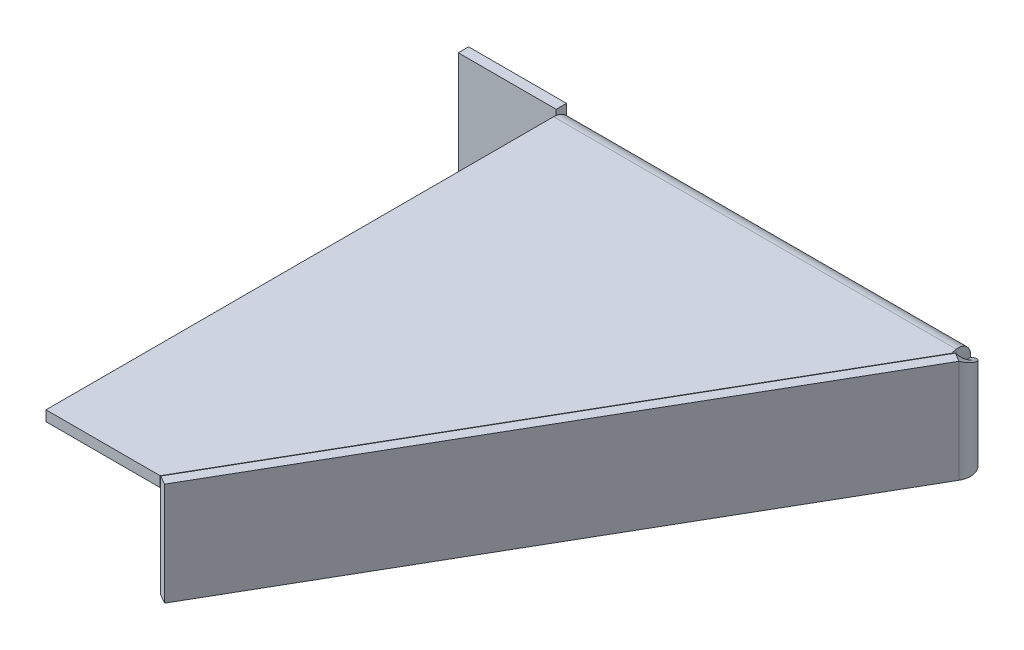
ISO-10303-21;
HEADER;
FILE_DESCRIPTION(('STEP AP214'),'2;1');
FILE_NAME('part.step','',(''),(''),'','','');
FILE_SCHEMA(('AUTOMOTIVE_DESIGN { 1 0 10303 214 1 1 1 1 }'));
ENDSEC;
DATA;
#1=APPLICATION_CONTEXT('core data for automotive mechanical design processes');
#2=APPLICATION_PROTOCOL_DEFINITION('international standard','automotive_design',2000,#1);
#3=PRODUCT_CONTEXT('',#1,'mechanical');
#4=PRODUCT('Part','Part','',(#3));
#5=PRODUCT_RELATED_PRODUCT_CATEGORY('part','',(#4));
#6=PRODUCT_DEFINITION_FORMATION('','',#4);
#7=PRODUCT_DEFINITION_CONTEXT('part definition',#1,'design');
#8=PRODUCT_DEFINITION('design','',#6,#7);
#9=PRODUCT_DEFINITION_SHAPE('','',#8);
#10=(LENGTH_UNIT() NAMED_UNIT(*) SI_UNIT(.MILLI.,.METRE.));
#11=(NAMED_UNIT(*) PLANE_ANGLE_UNIT() SI_UNIT($,.RADIAN.));
#12=(NAMED_UNIT(*) SI_UNIT($,.STERADIAN.) SOLID_ANGLE_UNIT());
#13=UNCERTAINTY_MEASURE_WITH_UNIT(LENGTH_MEASURE(1.E-05),#10,'distance_accuracy_value','');
#14=(GEOMETRIC_REPRESENTATION_CONTEXT(3) GLOBAL_UNCERTAINTY_ASSIGNED_CONTEXT((#13)) GLOBAL_UNIT_ASSIGNED_CONTEXT((#10,
#11,#12)) REPRESENTATION_CONTEXT('',''));
#15=CARTESIAN_POINT('',(0.,0.,0.));
#16=DIRECTION('',(0.,0.,1.));
#17=DIRECTION('',(1.,0.,0.));
#18=AXIS2_PLACEMENT_3D('',#15,#16,#17);
#19=CARTESIAN_POINT('',(0.,20.,2.));
#20=DIRECTION('',(0.,0.,-1.));
#21=DIRECTION('',(-1.,0.,0.));
#22=AXIS2_PLACEMENT_3D('',#19,#20,#21);
#23=PLANE('',#22);
#24=DIRECTION('',(0.,-1.,0.));
#25=VECTOR('',#24,1.);
#26=CARTESIAN_POINT('',(97.4019237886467,16.5,2.));
#27=LINE('',#26,#25);
#28=CARTESIAN_POINT('',(97.4019237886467,16.5,2.));
#29=VERTEX_POINT('',#28);
#30=CARTESIAN_POINT('',(97.4019237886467,0.,2.));
#31=VERTEX_POINT('',#30);
#32=EDGE_CURVE('E409',#29,#31,#27,.T.);
#33=ORIENTED_EDGE('',*,*,#32,.F.);
#34=DIRECTION('',(1.,0.,0.));
#35=VECTOR('',#34,1.);
#36=CARTESIAN_POINT('',(19.9999999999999,16.5,2.));
#37=LINE('',#36,#35);
#38=CARTESIAN_POINT('',(20.,16.5,2.));
#39=VERTEX_POINT('',#38);
#40=EDGE_CURVE('E512',#39,#29,#37,.T.);
#41=ORIENTED_EDGE('',*,*,#40,.F.);
#42=DIRECTION('',(0.,1.,0.));
#43=VECTOR('',#42,1.);
#44=CARTESIAN_POINT('',(19.9999999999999,15.5,2.));
#45=LINE('',#44,#43);
#46=CARTESIAN_POINT('',(19.9999999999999,15.5,2.));
#47=VERTEX_POINT('',#46);
#48=EDGE_CURVE('E500',#47,#39,#45,.T.);
#49=ORIENTED_EDGE('',*,*,#48,.F.);
#50=DIRECTION('',(1.,0.,0.));
#51=VECTOR('',#50,1.);
#52=CARTESIAN_POINT('',(18.9999999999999,15.5,1.99999999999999));
#53=LINE('',#52,#51);
#54=CARTESIAN_POINT('',(18.9999999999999,15.5,1.99999999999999));
#55=VERTEX_POINT('',#54);
#56=EDGE_CURVE('E499',#55,#47,#53,.T.);
#57=ORIENTED_EDGE('',*,*,#56,.F.);
#58=DIRECTION('',(0.,-1.,0.));
#59=VECTOR('',#58,1.);
#60=CARTESIAN_POINT('',(18.9999999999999,20.,1.99999999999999));
#61=LINE('',#60,#59);
#62=CARTESIAN_POINT('',(18.9999999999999,20.,1.99999999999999));
#63=VERTEX_POINT('',#62);
#64=EDGE_CURVE('E497',#63,#55,#61,.T.);
#65=ORIENTED_EDGE('',*,*,#64,.F.);
#66=DIRECTION('',(-1.,0.,0.));
#67=VECTOR('',#66,1.);
#68=CARTESIAN_POINT('',(0.,20.,2.));
#69=LINE('',#68,#67);
#70=CARTESIAN_POINT('',(0.,20.,2.));
#71=VERTEX_POINT('',#70);
#72=EDGE_CURVE('E417',#63,#71,#69,.T.);
#73=ORIENTED_EDGE('',*,*,#72,.T.);
#74=DIRECTION('',(0.,-1.,0.));
#75=VECTOR('',#74,1.);
#76=CARTESIAN_POINT('',(0.,0.,2.));
#77=LINE('',#76,#75);
#78=CARTESIAN_POINT('',(0.,0.,2.));
#79=VERTEX_POINT('',#78);
#80=EDGE_CURVE('E415',#71,#79,#77,.T.);
#81=ORIENTED_EDGE('',*,*,#80,.T.);
#82=DIRECTION('',(1.,0.,0.));
#83=VECTOR('',#82,1.);
#84=CARTESIAN_POINT('',(0.,0.,2.));
#85=LINE('',#84,#83);
#86=EDGE_CURVE('E403',#79,#31,#85,.T.);
#87=ORIENTED_EDGE('',*,*,#86,.T.);
#88=EDGE_LOOP('',(#33,#41,#49,#57,#65,#73,#81,#87));
#89=FACE_BOUND('',#88,.T.);
#90=ADVANCED_FACE('F72',(#89),#23,.F.);
#91=CARTESIAN_POINT('',(0.,20.,0.));
#92=DIRECTION('',(0.,0.,-1.));
#93=DIRECTION('',(-1.,0.,0.));
#94=AXIS2_PLACEMENT_3D('',#91,#92,#93);
#95=PLANE('',#94);
#96=DIRECTION('',(1.,0.,0.));
#97=VECTOR('',#96,1.);
#98=CARTESIAN_POINT('',(20.,16.5,0.));
#99=LINE('',#98,#97);
#100=CARTESIAN_POINT('',(20.,16.5,0.));
#101=VERTEX_POINT('',#100);
#102=CARTESIAN_POINT('',(97.4019237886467,16.5,0.));
#103=VERTEX_POINT('',#102);
#104=EDGE_CURVE('E81',#101,#103,#99,.T.);
#105=ORIENTED_EDGE('',*,*,#104,.T.);
#106=DIRECTION('',(0.,-1.,0.));
#107=VECTOR('',#106,1.);
#108=CARTESIAN_POINT('',(97.4019237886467,16.5,0.));
#109=LINE('',#108,#107);
#110=CARTESIAN_POINT('',(97.4019237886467,0.,0.));
#111=VERTEX_POINT('',#110);
#112=EDGE_CURVE('E408',#103,#111,#109,.T.);
#113=ORIENTED_EDGE('',*,*,#112,.T.);
#114=DIRECTION('',(1.,0.,0.));
#115=VECTOR('',#114,1.);
#116=CARTESIAN_POINT('',(0.,0.,0.));
#117=LINE('',#116,#115);
#118=CARTESIAN_POINT('',(0.,0.,0.));
#119=VERTEX_POINT('',#118);
#120=EDGE_CURVE('E97',#119,#111,#117,.T.);
#121=ORIENTED_EDGE('',*,*,#120,.F.);
#122=DIRECTION('',(0.,-1.,0.));
#123=VECTOR('',#122,1.);
#124=CARTESIAN_POINT('',(0.,0.,0.));
#125=LINE('',#124,#123);
#126=CARTESIAN_POINT('',(0.,20.,0.));
#127=VERTEX_POINT('',#126);
#128=EDGE_CURVE('E555',#127,#119,#125,.T.);
#129=ORIENTED_EDGE('',*,*,#128,.F.);
#130=DIRECTION('',(-1.,0.,0.));
#131=VECTOR('',#130,1.);
#132=CARTESIAN_POINT('',(0.,20.,0.));
#133=LINE('',#132,#131);
#134=CARTESIAN_POINT('',(18.9999999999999,20.,0.));
#135=VERTEX_POINT('',#134);
#136=EDGE_CURVE('E505',#135,#127,#133,.T.);
#137=ORIENTED_EDGE('',*,*,#136,.F.);
#138=DIRECTION('',(0.,-1.,0.));
#139=VECTOR('',#138,1.);
#140=CARTESIAN_POINT('',(18.9999999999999,20.,0.));
#141=LINE('',#140,#139);
#142=CARTESIAN_POINT('',(18.9999999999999,15.5,0.));
#143=VERTEX_POINT('',#142);
#144=EDGE_CURVE('E420',#135,#143,#141,.T.);
#145=ORIENTED_EDGE('',*,*,#144,.T.);
#146=DIRECTION('',(1.,0.,0.));
#147=VECTOR('',#146,1.);
#148=CARTESIAN_POINT('',(0.,15.5,0.));
#149=LINE('',#148,#147);
#150=CARTESIAN_POINT('',(20.,15.5,0.));
#151=VERTEX_POINT('',#150);
#152=EDGE_CURVE('E485',#143,#151,#149,.T.);
#153=ORIENTED_EDGE('',*,*,#152,.T.);
#154=DIRECTION('',(0.,1.,0.));
#155=VECTOR('',#154,1.);
#156=CARTESIAN_POINT('',(20.,20.,0.));
#157=LINE('',#156,#155);
#158=EDGE_CURVE('E493',#151,#101,#157,.T.);
#159=ORIENTED_EDGE('',*,*,#158,.T.);
#160=EDGE_LOOP('',(#105,#113,#121,#129,#137,#145,#153,#159));
#161=FACE_BOUND('',#160,.T.);
#162=ADVANCED_FACE('F381',(#161),#95,.T.);
#163=CARTESIAN_POINT('',(0.,0.,2.));
#164=DIRECTION('',(0.,1.,0.));
#165=DIRECTION('',(0.,0.,1.));
#166=AXIS2_PLACEMENT_3D('',#163,#164,#165);
#167=PLANE('',#166);
#168=DIRECTION('',(0.,0.,-1.));
#169=VECTOR('',#168,1.);
#170=CARTESIAN_POINT('',(97.4019237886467,0.,2.));
#171=LINE('',#170,#169);
#172=EDGE_CURVE('E401',#31,#111,#171,.T.);
#173=ORIENTED_EDGE('',*,*,#172,.F.);
#174=ORIENTED_EDGE('',*,*,#86,.F.);
#175=DIRECTION('',(0.,0.,-1.));
#176=VECTOR('',#175,1.);
#177=CARTESIAN_POINT('',(0.,0.,2.));
#178=LINE('',#177,#176);
#179=EDGE_CURVE('E562',#79,#119,#178,.T.);
#180=ORIENTED_EDGE('',*,*,#179,.T.);
#181=ORIENTED_EDGE('',*,*,#120,.T.);
#182=EDGE_LOOP('',(#173,#174,#180,#181));
#183=FACE_BOUND('',#182,.T.);
#184=ADVANCED_FACE('F387',(#183),#167,.F.);
#185=CARTESIAN_POINT('',(0.,20.,2.));
#186=DIRECTION('',(0.,-1.,0.));
#187=DIRECTION('',(0.,0.,-1.));
#188=AXIS2_PLACEMENT_3D('',#185,#186,#187);
#189=PLANE('',#188);
#190=DIRECTION('',(0.,0.,-1.));
#191=VECTOR('',#190,1.);
#192=CARTESIAN_POINT('',(18.9999999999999,20.,1.99999999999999));
#193=LINE('',#192,#191);
#194=EDGE_CURVE('E550',#63,#135,#193,.T.);
#195=ORIENTED_EDGE('',*,*,#194,.T.);
#196=ORIENTED_EDGE('',*,*,#136,.T.);
#197=DIRECTION('',(0.,0.,-1.));
#198=VECTOR('',#197,1.);
#199=CARTESIAN_POINT('',(0.,20.,2.));
#200=LINE('',#199,#198);
#201=EDGE_CURVE('E554',#71,#127,#200,.T.);
#202=ORIENTED_EDGE('',*,*,#201,.F.);
#203=ORIENTED_EDGE('',*,*,#72,.F.);
#204=EDGE_LOOP('',(#195,#196,#202,#203));
#205=FACE_BOUND('',#204,.T.);
#206=ADVANCED_FACE('F394',(#205),#189,.F.);
#207=CARTESIAN_POINT('',(0.,0.,2.));
#208=DIRECTION('',(1.,0.,0.));
#209=DIRECTION('',(0.,0.,-1.));
#210=AXIS2_PLACEMENT_3D('',#207,#208,#209);
#211=PLANE('',#210);
#212=ORIENTED_EDGE('',*,*,#128,.T.);
#213=ORIENTED_EDGE('',*,*,#179,.F.);
#214=ORIENTED_EDGE('',*,*,#80,.F.);
#215=ORIENTED_EDGE('',*,*,#201,.T.);
#216=EDGE_LOOP('',(#212,#213,#214,#215));
#217=FACE_BOUND('',#216,.T.);
#218=ADVANCED_FACE('F74',(#217),#211,.F.);
#219=CARTESIAN_POINT('',(18.9999999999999,20.,1.99999999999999));
#220=DIRECTION('',(1.,0.,0.));
#221=DIRECTION('',(0.,0.,-1.));
#222=AXIS2_PLACEMENT_3D('',#219,#220,#221);
#223=PLANE('',#222);
#224=ORIENTED_EDGE('',*,*,#144,.F.);
#225=ORIENTED_EDGE('',*,*,#194,.F.);
#226=ORIENTED_EDGE('',*,*,#64,.T.);
#227=DIRECTION('',(0.,0.,-1.));
#228=VECTOR('',#227,1.);
#229=CARTESIAN_POINT('',(18.9999999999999,15.5,1.99999999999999));
#230=LINE('',#229,#228);
#231=EDGE_CURVE('E488',#55,#143,#230,.T.);
#232=ORIENTED_EDGE('',*,*,#231,.T.);
#233=EDGE_LOOP('',(#224,#225,#226,#232));
#234=FACE_BOUND('',#233,.T.);
#235=ADVANCED_FACE('F391',(#234),#223,.T.);
#236=CARTESIAN_POINT('',(18.9999999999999,15.5,1.99999999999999));
#237=DIRECTION('',(0.,1.,0.));
#238=DIRECTION('',(0.,0.,1.));
#239=AXIS2_PLACEMENT_3D('',#236,#237,#238);
#240=PLANE('',#239);
#241=ORIENTED_EDGE('',*,*,#152,.F.);
#242=ORIENTED_EDGE('',*,*,#231,.F.);
#243=ORIENTED_EDGE('',*,*,#56,.T.);
#244=DIRECTION('',(0.,0.,-1.));
#245=VECTOR('',#244,1.);
#246=CARTESIAN_POINT('',(19.9999999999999,15.5,2.));
#247=LINE('',#246,#245);
#248=EDGE_CURVE('E490',#47,#151,#247,.T.);
#249=ORIENTED_EDGE('',*,*,#248,.T.);
#250=EDGE_LOOP('',(#241,#242,#243,#249));
#251=FACE_BOUND('',#250,.T.);
#252=ADVANCED_FACE('F475',(#251),#240,.T.);
#253=CARTESIAN_POINT('',(19.9999999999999,15.5,2.));
#254=DIRECTION('',(-1.,0.,0.));
#255=DIRECTION('',(0.,0.,1.));
#256=AXIS2_PLACEMENT_3D('',#253,#254,#255);
#257=PLANE('',#256);
#258=ORIENTED_EDGE('',*,*,#158,.F.);
#259=ORIENTED_EDGE('',*,*,#248,.F.);
#260=ORIENTED_EDGE('',*,*,#48,.T.);
#261=DIRECTION('',(0.,0.,-1.));
#262=VECTOR('',#261,1.);
#263=CARTESIAN_POINT('',(19.9999999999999,16.5,2.));
#264=LINE('',#263,#262);
#265=EDGE_CURVE('E13',#39,#101,#264,.T.);
#266=ORIENTED_EDGE('',*,*,#265,.T.);
#267=EDGE_LOOP('',(#258,#259,#260,#266));
#268=FACE_BOUND('',#267,.T.);
#269=ADVANCED_FACE('F472',(#268),#257,.T.);
#270=CARTESIAN_POINT('',(43.9970238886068,0.,103.));
#271=DIRECTION('',(0.499999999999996,0.,-0.866025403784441));
#272=DIRECTION('',(-0.866025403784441,0.,-0.499999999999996));
#273=AXIS2_PLACEMENT_3D('',#270,#271,#272);
#274=PLANE('',#273);
#275=DIRECTION('',(0.,-1.,0.));
#276=VECTOR('',#275,1.);
#277=CARTESIAN_POINT('',(42.2649730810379,0.,102.));
#278=LINE('',#277,#276);
#279=CARTESIAN_POINT('',(42.2649730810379,20.0000000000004,102.));
#280=VERTEX_POINT('',#279);
#281=CARTESIAN_POINT('',(42.2649730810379,0.,102.));
#282=VERTEX_POINT('',#281);
#283=EDGE_CURVE('E435',#280,#282,#278,.T.);
#284=ORIENTED_EDGE('',*,*,#283,.T.);
#285=DIRECTION('',(-0.866025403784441,0.,-0.499999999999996));
#286=VECTOR('',#285,1.);
#287=CARTESIAN_POINT('',(43.9970238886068,0.,103.));
#288=LINE('',#287,#286);
#289=CARTESIAN_POINT('',(43.9970238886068,0.,103.));
#290=VERTEX_POINT('',#289);
#291=EDGE_CURVE('E428',#290,#282,#288,.T.);
#292=ORIENTED_EDGE('',*,*,#291,.F.);
#293=DIRECTION('',(0.,-1.,0.));
#294=VECTOR('',#293,1.);
#295=CARTESIAN_POINT('',(43.9970238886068,0.,103.));
#296=LINE('',#295,#294);
#297=CARTESIAN_POINT('',(43.9970238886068,20.0000000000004,103.));
#298=VERTEX_POINT('',#297);
#299=EDGE_CURVE('E528',#298,#290,#296,.T.);
#300=ORIENTED_EDGE('',*,*,#299,.F.);
#301=DIRECTION('',(-0.866025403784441,0.,-0.499999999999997));
#302=VECTOR('',#301,1.);
#303=CARTESIAN_POINT('',(43.9970238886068,20.0000000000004,103.));
#304=LINE('',#303,#302);
#305=EDGE_CURVE('E429',#298,#280,#304,.T.);
#306=ORIENTED_EDGE('',*,*,#305,.T.);
#307=EDGE_LOOP('',(#284,#292,#300,#306));
#308=FACE_BOUND('',#307,.T.);
#309=ADVANCED_FACE('F474',(#308),#274,.F.);
#310=CARTESIAN_POINT('',(100.,16.5,1.99999999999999));
#311=DIRECTION('',(-0.866025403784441,0.,-0.499999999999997));
#312=DIRECTION('',(-0.499999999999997,0.,0.866025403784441));
#313=AXIS2_PLACEMENT_3D('',#310,#311,#312);
#314=PLANE('',#313);
#315=ORIENTED_EDGE('',*,*,#283,.F.);
#316=DIRECTION('',(-0.499999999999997,0.,0.866025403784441));
#317=VECTOR('',#316,1.);
#318=CARTESIAN_POINT('',(98.7009618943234,20.,4.24999999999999));
#319=LINE('',#318,#317);
#320=CARTESIAN_POINT('',(98.7009618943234,20.,4.24999999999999));
#321=VERTEX_POINT('',#320);
#322=EDGE_CURVE('E444',#321,#280,#319,.T.);
#323=ORIENTED_EDGE('',*,*,#322,.F.);
#324=DIRECTION('',(0.,1.,0.));
#325=VECTOR('',#324,1.);
#326=CARTESIAN_POINT('',(98.7009618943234,0.,4.24999999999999));
#327=LINE('',#326,#325);
#328=CARTESIAN_POINT('',(98.7009618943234,0.,4.24999999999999));
#329=VERTEX_POINT('',#328);
#330=EDGE_CURVE('E318',#329,#321,#327,.T.);
#331=ORIENTED_EDGE('',*,*,#330,.F.);
#332=DIRECTION('',(0.499999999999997,0.,-0.866025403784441));
#333=VECTOR('',#332,1.);
#334=CARTESIAN_POINT('',(100.,0.,1.99999999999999));
#335=LINE('',#334,#333);
#336=EDGE_CURVE('E432',#282,#329,#335,.T.);
#337=ORIENTED_EDGE('',*,*,#336,.F.);
#338=EDGE_LOOP('',(#315,#323,#331,#337));
#339=FACE_BOUND('',#338,.T.);
#340=ADVANCED_FACE('F537',(#339),#314,.T.);
#341=CARTESIAN_POINT('',(101.732050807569,0.,2.99999999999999));
#342=DIRECTION('',(0.,1.,0.));
#343=DIRECTION('',(0.,0.,1.));
#344=AXIS2_PLACEMENT_3D('',#341,#342,#343);
#345=PLANE('',#344);
#346=DIRECTION('',(0.866025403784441,0.,0.499999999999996));
#347=VECTOR('',#346,1.);
#348=CARTESIAN_POINT('',(98.7009618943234,0.,4.24999999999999));
#349=LINE('',#348,#347);
#350=CARTESIAN_POINT('',(100.433012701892,0.,5.24999999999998));
#351=VERTEX_POINT('',#350);
#352=EDGE_CURVE('E423',#329,#351,#349,.T.);
#353=ORIENTED_EDGE('',*,*,#352,.T.);
#354=DIRECTION('',(0.499999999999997,0.,-0.866025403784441));
#355=VECTOR('',#354,1.);
#356=CARTESIAN_POINT('',(101.732050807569,0.,2.99999999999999));
#357=LINE('',#356,#355);
#358=EDGE_CURVE('E448',#290,#351,#357,.T.);
#359=ORIENTED_EDGE('',*,*,#358,.F.);
#360=ORIENTED_EDGE('',*,*,#291,.T.);
#361=ORIENTED_EDGE('',*,*,#336,.T.);
#362=EDGE_LOOP('',(#353,#359,#360,#361));
#363=FACE_BOUND('',#362,.T.);
#364=ADVANCED_FACE('F535',(#363),#345,.F.);
#365=CARTESIAN_POINT('',(101.732050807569,16.5,2.99999999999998));
#366=DIRECTION('',(-0.866025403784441,0.,-0.499999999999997));
#367=DIRECTION('',(-0.499999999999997,0.,0.866025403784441));
#368=AXIS2_PLACEMENT_3D('',#365,#366,#367);
#369=PLANE('',#368);
#370=DIRECTION('',(0.,-1.,0.));
#371=VECTOR('',#370,1.);
#372=CARTESIAN_POINT('',(100.433012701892,16.5,5.24999999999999));
#373=LINE('',#372,#371);
#374=CARTESIAN_POINT('',(100.433012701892,20.,5.24999999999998));
#375=VERTEX_POINT('',#374);
#376=EDGE_CURVE('E440',#375,#351,#373,.T.);
#377=ORIENTED_EDGE('',*,*,#376,.F.);
#378=DIRECTION('',(-0.499999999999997,0.,0.866025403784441));
#379=VECTOR('',#378,1.);
#380=CARTESIAN_POINT('',(100.433012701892,20.,5.24999999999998));
#381=LINE('',#380,#379);
#382=EDGE_CURVE('E459',#375,#298,#381,.T.);
#383=ORIENTED_EDGE('',*,*,#382,.T.);
#384=ORIENTED_EDGE('',*,*,#299,.T.);
#385=ORIENTED_EDGE('',*,*,#358,.T.);
#386=EDGE_LOOP('',(#377,#383,#384,#385));
#387=FACE_BOUND('',#386,.T.);
#388=ADVANCED_FACE('F470',(#387),#369,.F.);
#389=CARTESIAN_POINT('',(100.433012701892,20.,5.24999999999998));
#390=DIRECTION('',(0.,-1.,0.));
#391=DIRECTION('',(0.,0.,-1.));
#392=AXIS2_PLACEMENT_3D('',#389,#390,#391);
#393=PLANE('',#392);
#394=ORIENTED_EDGE('',*,*,#322,.T.);
#395=ORIENTED_EDGE('',*,*,#305,.F.);
#396=ORIENTED_EDGE('',*,*,#382,.F.);
#397=CARTESIAN_POINT('',(98.6836413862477,20.,4.23999999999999));
#398=CARTESIAN_POINT('',(98.7009618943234,20.,4.24999999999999));
#399=CARTESIAN_POINT('',(100.433012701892,20.,5.24999999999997));
#400=CARTESIAN_POINT('',(100.450506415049,20.,5.26009999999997));
#401=B_SPLINE_CURVE_WITH_KNOTS('',1,(#397,#398,#399,#400),.UNSPECIFIED.,.F.,.F.,(2,1,1,2),
(-0.0101,-9.9999999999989E-05,0.9999,1.01),.UNSPECIFIED.);
#402=EDGE_CURVE('E447',#375,#321,#401,.F.);
#403=ORIENTED_EDGE('',*,*,#402,.T.);
#404=EDGE_LOOP('',(#394,#395,#396,#403));
#405=FACE_BOUND('',#404,.T.);
#406=ADVANCED_FACE('F345',(#405),#393,.F.);
#407=CARTESIAN_POINT('',(100.450506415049,20.,5.26009999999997));
#408=CARTESIAN_POINT('',(100.757843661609,19.7081983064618,4.72777627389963));
#409=CARTESIAN_POINT('',(100.922123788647,19.4166666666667,4.11439080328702));
#410=CARTESIAN_POINT('',(100.922123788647,18.8333333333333,2.88560919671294));
#411=CARTESIAN_POINT('',(100.757701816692,18.5416666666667,2.27197804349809));
#412=CARTESIAN_POINT('',(100.143311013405,17.9583333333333,1.20782195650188));
#413=CARTESIAN_POINT('',(99.6941018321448,17.6666666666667,0.758612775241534));
#414=CARTESIAN_POINT('',(98.6299457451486,17.0833333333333,0.144221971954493));
#415=CARTESIAN_POINT('',(98.0165982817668,16.7918016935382,-0.0202000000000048));
#416=CARTESIAN_POINT('',(97.4019237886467,16.5,-0.0202000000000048));
#417=CARTESIAN_POINT('',(100.433012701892,20.,5.24999999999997));
#418=CARTESIAN_POINT('',(100.738586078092,19.7081989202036,4.72073138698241));
#419=CARTESIAN_POINT('',(100.901923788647,19.4166666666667,4.11086523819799));
#420=CARTESIAN_POINT('',(100.901923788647,18.8333333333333,2.88913476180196));
#421=CARTESIAN_POINT('',(100.738445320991,18.5416666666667,2.27902481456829));
#422=CARTESIAN_POINT('',(100.127580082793,17.9583333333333,1.22097518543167));
#423=CARTESIAN_POINT('',(99.680948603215,17.6666666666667,0.774343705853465));
#424=CARTESIAN_POINT('',(98.6228989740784,17.0833333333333,0.163478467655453));
#425=CARTESIAN_POINT('',(98.0130705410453,16.7918010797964,0.));
#426=CARTESIAN_POINT('',(97.4019237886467,16.5,0.));
#427=CARTESIAN_POINT('',(98.7009618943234,20.,4.24999999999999));
#428=CARTESIAN_POINT('',(98.8318946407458,19.7082596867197,4.02321783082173));
#429=CARTESIAN_POINT('',(98.9019237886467,19.4166666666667,3.76179938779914));
#430=CARTESIAN_POINT('',(98.9019237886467,18.8333333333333,3.23820061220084));
#431=CARTESIAN_POINT('',(98.8318615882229,18.5416666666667,2.97672492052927));
#432=CARTESIAN_POINT('',(98.5700622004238,17.9583333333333,2.52327507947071));
#433=CARTESIAN_POINT('',(98.378648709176,17.6666666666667,2.33186158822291));
#434=CARTESIAN_POINT('',(97.9251988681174,17.0833333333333,2.07006220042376));
#435=CARTESIAN_POINT('',(97.6637892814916,16.7917403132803,2.));
#436=CARTESIAN_POINT('',(97.4019237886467,16.5,2.));
#437=CARTESIAN_POINT('',(98.6836413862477,20.,4.23999999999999));
#438=CARTESIAN_POINT('',(98.8128277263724,19.7082602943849,4.01624269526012));
#439=CARTESIAN_POINT('',(98.8819237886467,19.4166666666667,3.75830872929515));
#440=CARTESIAN_POINT('',(98.8819237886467,18.8333333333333,3.24169127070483));
#441=CARTESIAN_POINT('',(98.8127957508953,18.5416666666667,2.98370192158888));
#442=CARTESIAN_POINT('',(98.5544870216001,17.9583333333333,2.53629807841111));
#443=CARTESIAN_POINT('',(98.3656257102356,17.6666666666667,2.3474367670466));
#444=CARTESIAN_POINT('',(97.9182218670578,17.0833333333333,2.08912803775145));
#445=CARTESIAN_POINT('',(97.6602964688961,16.7917397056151,2.02));
#446=CARTESIAN_POINT('',(97.4019237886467,16.5,2.02));
#447=B_SPLINE_SURFACE_WITH_KNOTS('',1,3,((#407,#408,#409,#410,#411,#412,#413,#414,#415,#416),
(#417,#418,#419,#420,#421,#422,#423,#424,#425,#426),(#427,#428,#429,#430,#431,#432,#433,#434,
#435,#436),(#437,#438,#439,#440,#441,#442,#443,#444,#445,#446)),.UNSPECIFIED.,.F.,.F.,.F.,(2,1,
1,2),(4,2,2,2,4),(-0.0101,0.,1.,1.01),(0.,0.25,0.5,0.75,1.),.UNSPECIFIED.);
#448=CARTESIAN_POINT('',(100.433012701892,20.,5.24999999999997));
#449=CARTESIAN_POINT('',(100.487590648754,19.9478905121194,5.15549976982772));
#450=CARTESIAN_POINT('',(100.537720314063,19.8957801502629,5.05843467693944));
#451=CARTESIAN_POINT('',(100.628706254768,19.791566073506,4.86005612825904));
#452=CARTESIAN_POINT('',(100.66956308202,19.7394623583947,4.75874292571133));
#453=CARTESIAN_POINT('',(100.741602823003,19.6353075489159,4.55282462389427));
#454=CARTESIAN_POINT('',(100.772793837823,19.5832564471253,4.44822236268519));
#455=CARTESIAN_POINT('',(100.825278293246,19.4791531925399,4.23656626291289));
#456=CARTESIAN_POINT('',(100.84657187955,19.4271010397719,4.12951246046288));
#457=CARTESIAN_POINT('',(100.879087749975,19.322946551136,3.91380816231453));
#458=CARTESIAN_POINT('',(100.89030238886,19.2708442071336,3.80515651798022));
#459=CARTESIAN_POINT('',(100.90253838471,19.1666237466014,3.5872388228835));
#460=CARTESIAN_POINT('',(100.903555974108,19.1145056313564,3.47797255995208));
#461=CARTESIAN_POINT('',(100.895381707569,19.0102969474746,3.25989305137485));
#462=CARTESIAN_POINT('',(100.886196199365,18.9582063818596,3.15107956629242));
#463=CARTESIAN_POINT('',(100.857700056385,18.8540163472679,2.93474083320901));
#464=CARTESIAN_POINT('',(100.838385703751,18.8019168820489,2.82721607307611));
#465=CARTESIAN_POINT('',(100.789805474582,18.6977388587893,2.61447252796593));
#466=CARTESIAN_POINT('',(100.76054276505,18.6456602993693,2.50925302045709));
#467=CARTESIAN_POINT('',(100.692309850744,18.5414784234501,2.30197289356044));
#468=CARTESIAN_POINT('',(100.653336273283,18.48937510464,2.19991338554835));
#469=CARTESIAN_POINT('',(100.566027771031,18.385159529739,1.99988153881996));
#470=CARTESIAN_POINT('',(100.517692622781,18.3330472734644,1.90190929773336));
#471=CARTESIAN_POINT('',(100.412081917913,18.2288264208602,1.71090620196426));
#472=CARTESIAN_POINT('',(100.35480636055,18.176717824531,1.61787534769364));
#473=CARTESIAN_POINT('',(100.231811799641,18.0724954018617,1.43756328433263));
#474=CARTESIAN_POINT('',(100.166092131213,18.0203815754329,1.35028252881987));
#475=CARTESIAN_POINT('',(100.026807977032,17.9161826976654,1.18226709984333));
#476=CARTESIAN_POINT('',(99.9532462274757,17.8640976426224,1.10153016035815));
#477=CARTESIAN_POINT('',(99.7988780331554,17.7599095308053,0.947252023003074));
#478=CARTESIAN_POINT('',(99.7180691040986,17.7078064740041,0.873713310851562));
#479=CARTESIAN_POINT('',(99.5499702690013,17.6036089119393,0.734534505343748));
#480=CARTESIAN_POINT('',(99.4626827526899,17.5515144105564,0.668891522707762));
#481=CARTESIAN_POINT('',(99.2822975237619,17.4472908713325,0.546000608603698));
#482=CARTESIAN_POINT('',(99.1891958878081,17.3951618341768,0.488758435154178));
#483=CARTESIAN_POINT('',(98.9980881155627,17.2909198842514,0.383243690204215));
#484=CARTESIAN_POINT('',(98.9000837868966,17.2388069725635,0.334967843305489));
#485=CARTESIAN_POINT('',(98.7000177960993,17.134602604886,0.24779259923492));
#486=CARTESIAN_POINT('',(98.5979572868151,17.0825111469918,0.208890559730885));
#487=CARTESIAN_POINT('',(98.3906812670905,16.9783521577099,0.140794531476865));
#488=CARTESIAN_POINT('',(98.2854666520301,16.9262846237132,0.111597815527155));
#489=CARTESIAN_POINT('',(98.0516534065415,16.811802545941,0.0583556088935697));
#490=CARTESIAN_POINT('',(97.9225566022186,16.7493844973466,0.0364811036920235));
#491=CARTESIAN_POINT('',(97.6629430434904,16.6246426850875,0.00729723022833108));
#492=CARTESIAN_POINT('',(97.5324289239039,16.5623189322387,-3.56422220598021E-05));
#493=CARTESIAN_POINT('',(97.4019237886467,16.5,0.));
#494=B_SPLINE_CURVE_WITH_KNOTS('',3,(#448,#449,#450,#451,#452,#453,#454,#455,#456,#457,#458,
#459,#460,#461,#462,#463,#464,#465,#466,#467,#468,#469,#470,#471,#472,#473,#474,#475,#476,#477,
#478,#479,#480,#481,#482,#483,#484,#485,#486,#487,#488,#489,#490,#491,#492,#493),.UNSPECIFIED.,
.F.,.F.,(4,2,2,2,2,2,2,2,2,2,2,2,2,2,2,2,2,2,2,2,2,2,4),(0.,0.362683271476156,0.725344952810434,
1.087701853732,1.45005342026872,1.81267961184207,2.1754397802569,2.53797438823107,
2.90064216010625,3.2631945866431,3.62587310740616,3.98856028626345,4.35124749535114,
4.71396327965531,5.07655291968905,5.43926733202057,5.80184861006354,6.16467725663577,
6.52737310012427,6.8899665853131,7.25245809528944,7.68686196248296,8.12056311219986),.UNSPECIFIED.);
#495=EDGE_CURVE('E322',#375,#103,#494,.T.);
#496=CARTESIAN_POINT('',(97.4019237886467,16.5,2.));
#497=CARTESIAN_POINT('',(97.4019237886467,16.5,0.));
#498=B_SPLINE_CURVE_WITH_KNOTS('',1,(#496,#497),.UNSPECIFIED.,.F.,.F.,(2,2),(0.,1.),.UNSPECIFIED.);
#499=EDGE_CURVE('E296',#29,#103,#498,.T.);
#500=CARTESIAN_POINT('',(98.7009618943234,20.,4.24999999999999));
#501=CARTESIAN_POINT('',(98.732623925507,19.929484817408,4.19520586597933));
#502=CARTESIAN_POINT('',(98.7607784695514,19.8589736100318,4.13838704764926));
#503=CARTESIAN_POINT('',(98.8097092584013,19.7179641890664,4.02165703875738));
#504=CARTESIAN_POINT('',(98.830486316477,19.6474659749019,3.9617461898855));
#505=CARTESIAN_POINT('',(98.8642809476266,19.506576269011,3.83986678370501));
#506=CARTESIAN_POINT('',(98.8773099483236,19.4361847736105,3.77790139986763));
#507=CARTESIAN_POINT('',(98.8954542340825,19.2953939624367,3.65283540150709));
#508=CARTESIAN_POINT('',(98.9005697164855,19.2249946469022,3.5897348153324));
#509=CARTESIAN_POINT('',(98.902811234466,19.0839579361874,3.46317630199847));
#510=CARTESIAN_POINT('',(98.8999101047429,19.0133205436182,3.39971788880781));
#511=CARTESIAN_POINT('',(98.8861052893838,18.8720493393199,3.27367054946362));
#512=CARTESIAN_POINT('',(98.8752014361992,18.8014155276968,3.21108164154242));
#513=CARTESIAN_POINT('',(98.8455716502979,18.6601924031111,3.08781524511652));
#514=CARTESIAN_POINT('',(98.8268501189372,18.589603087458,3.02713670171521));
#515=CARTESIAN_POINT('',(98.7818927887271,18.4484146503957,2.9086442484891));
#516=CARTESIAN_POINT('',(98.7556570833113,18.3778155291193,2.85083030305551));
#517=CARTESIAN_POINT('',(98.696091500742,18.2366246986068,2.73898522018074));
#518=CARTESIAN_POINT('',(98.6627622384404,18.1660329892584,2.68495375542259));
#519=CARTESIAN_POINT('',(98.5895406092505,18.0248525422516,2.58153339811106));
#520=CARTESIAN_POINT('',(98.5496482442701,17.9542638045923,2.53214450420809));
#521=CARTESIAN_POINT('',(98.4638990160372,17.8130342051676,2.4387603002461));
#522=CARTESIAN_POINT('',(98.4180371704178,17.7423933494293,2.39476955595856));
#523=CARTESIAN_POINT('',(98.3211287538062,17.6011037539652,2.31295146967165));
#524=CARTESIAN_POINT('',(98.2700823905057,17.5304550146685,2.27512388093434));
#525=CARTESIAN_POINT('',(98.1635733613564,17.3891029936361,2.2062008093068));
#526=CARTESIAN_POINT('',(98.1081072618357,17.3183997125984,2.17511063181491));
#527=CARTESIAN_POINT('',(97.9936854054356,17.1769959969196,2.12020111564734));
#528=CARTESIAN_POINT('',(97.9347297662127,17.1062955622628,2.09638153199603));
#529=CARTESIAN_POINT('',(97.8143897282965,16.9650455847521,2.05643371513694));
#530=CARTESIAN_POINT('',(97.7530103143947,16.8944960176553,2.04029050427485));
#531=CARTESIAN_POINT('',(97.628740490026,16.7534189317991,2.01589770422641));
#532=CARTESIAN_POINT('',(97.5658510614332,16.6828914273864,2.00764312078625));
#533=CARTESIAN_POINT('',(97.4859359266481,16.5936468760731,2.00225984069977));
#534=CARTESIAN_POINT('',(97.4691369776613,16.574907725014,2.00141213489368));
#535=CARTESIAN_POINT('',(97.4355340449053,16.5374461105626,2.00028257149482));
#536=CARTESIAN_POINT('',(97.4187300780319,16.5187236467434,2.00000022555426));
#537=CARTESIAN_POINT('',(97.4019237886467,16.5,2.));
#538=B_SPLINE_CURVE_WITH_KNOTS('',3,(#500,#501,#502,#503,#504,#505,#506,#507,#508,#509,#510,
#511,#512,#513,#514,#515,#516,#517,#518,#519,#520,#521,#522,#523,#524,#525,#526,#527,#528,#529,
#530,#531,#532,#533,#534,#535,#536,#537),.UNSPECIFIED.,.F.,.F.,(4,2,2,2,2,2,2,2,2,2,2,2,2,2,2,2,
2,2,4),(0.,0.284155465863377,0.568279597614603,0.851983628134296,1.13568058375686,
1.42034006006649,1.70500549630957,1.98951088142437,2.2740127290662,2.55848992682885,
2.84296704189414,3.12768313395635,3.41238782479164,3.69731589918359,3.98223437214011,
4.26659462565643,4.55077473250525,4.62631360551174,4.70178720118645),.UNSPECIFIED.);
#539=EDGE_CURVE('E319',#321,#29,#538,.T.);
#540=ORIENTED_EDGE('',*,*,#402,.F.);
#541=ORIENTED_EDGE('',*,*,#495,.T.);
#542=ORIENTED_EDGE('',*,*,#499,.F.);
#543=ORIENTED_EDGE('',*,*,#539,.F.);
#544=EDGE_LOOP('',(#540,#541,#542,#543));
#545=FACE_BOUND('',#544,.T.);
#546=ADVANCED_FACE('F332',(#545),#447,.F.);
#547=CARTESIAN_POINT('',(97.4019237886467,0.,3.5));
#548=DIRECTION('',(0.,1.,0.));
#549=DIRECTION('',(0.,0.,1.));
#550=AXIS2_PLACEMENT_3D('',#547,#548,#549);
#551=PLANE('',#550);
#552=CARTESIAN_POINT('',(97.4019237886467,0.,3.5));
#553=DIRECTION('',(0.,-1.,0.));
#554=DIRECTION('',(0.,0.,-1.));
#555=AXIS2_PLACEMENT_3D('',#552,#553,#554);
#556=CIRCLE('',#555,3.5);
#557=EDGE_CURVE('E320',#111,#351,#556,.T.);
#558=ORIENTED_EDGE('',*,*,#557,.T.);
#559=ORIENTED_EDGE('',*,*,#352,.F.);
#560=CARTESIAN_POINT('',(97.4019237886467,0.,3.5));
#561=DIRECTION('',(0.,-1.,0.));
#562=DIRECTION('',(0.,0.,-1.));
#563=AXIS2_PLACEMENT_3D('',#560,#561,#562);
#564=CIRCLE('',#563,1.5);
#565=EDGE_CURVE('E310',#31,#329,#564,.T.);
#566=ORIENTED_EDGE('',*,*,#565,.F.);
#567=ORIENTED_EDGE('',*,*,#172,.T.);
#568=EDGE_LOOP('',(#558,#559,#566,#567));
#569=FACE_BOUND('',#568,.T.);
#570=ADVANCED_FACE('F344',(#569),#551,.F.);
#571=CARTESIAN_POINT('',(97.4019237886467,31.2026781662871,3.5));
#572=DIRECTION('',(0.,-1.,0.));
#573=DIRECTION('',(0.,0.,-1.));
#574=AXIS2_PLACEMENT_3D('',#571,#572,#573);
#575=CYLINDRICAL_SURFACE('',#574,1.5);
#576=ORIENTED_EDGE('',*,*,#32,.T.);
#577=ORIENTED_EDGE('',*,*,#565,.T.);
#578=ORIENTED_EDGE('',*,*,#330,.T.);
#579=ORIENTED_EDGE('',*,*,#539,.T.);
#580=EDGE_LOOP('',(#576,#577,#578,#579));
#581=FACE_BOUND('',#580,.T.);
#582=ADVANCED_FACE('F346',(#581),#575,.F.);
#583=CARTESIAN_POINT('',(97.4019237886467,31.2026781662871,3.5));
#584=DIRECTION('',(0.,-1.,0.));
#585=DIRECTION('',(0.,0.,-1.));
#586=AXIS2_PLACEMENT_3D('',#583,#584,#585);
#587=CYLINDRICAL_SURFACE('',#586,3.5);
#588=ORIENTED_EDGE('',*,*,#112,.F.);
#589=ORIENTED_EDGE('',*,*,#495,.F.);
#590=ORIENTED_EDGE('',*,*,#376,.T.);
#591=ORIENTED_EDGE('',*,*,#557,.F.);
#592=EDGE_LOOP('',(#588,#589,#590,#591));
#593=FACE_BOUND('',#592,.T.);
#594=ADVANCED_FACE('F347',(#593),#587,.T.);
#595=CARTESIAN_POINT('',(20.,16.5,3.5));
#596=DIRECTION('',(1.,0.,0.));
#597=DIRECTION('',(0.,0.,-1.));
#598=AXIS2_PLACEMENT_3D('',#595,#596,#597);
#599=PLANE('',#598);
#600=DIRECTION('',(0.,1.,0.));
#601=VECTOR('',#600,1.);
#602=CARTESIAN_POINT('',(20.,18.,3.5));
#603=LINE('',#602,#601);
#604=CARTESIAN_POINT('',(20.,18.,3.49999999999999));
#605=VERTEX_POINT('',#604);
#606=CARTESIAN_POINT('',(19.9999999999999,20.,3.50000000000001));
#607=VERTEX_POINT('',#606);
#608=EDGE_CURVE('E199',#605,#607,#603,.T.);
#609=ORIENTED_EDGE('',*,*,#608,.T.);
#610=CARTESIAN_POINT('',(20.,16.5,3.5));
#611=DIRECTION('',(-1.,0.,0.));
#612=DIRECTION('',(0.,0.,1.));
#613=AXIS2_PLACEMENT_3D('',#610,#611,#612);
#614=CIRCLE('',#613,3.5);
#615=EDGE_CURVE('E89',#607,#101,#614,.T.);
#616=ORIENTED_EDGE('',*,*,#615,.T.);
#617=ORIENTED_EDGE('',*,*,#265,.F.);
#618=CARTESIAN_POINT('',(20.,16.5,3.5));
#619=DIRECTION('',(-1.,0.,0.));
#620=DIRECTION('',(0.,0.,1.));
#621=AXIS2_PLACEMENT_3D('',#618,#619,#620);
#622=CIRCLE('',#621,1.5);
#623=EDGE_CURVE('E227',#605,#39,#622,.T.);
#624=ORIENTED_EDGE('',*,*,#623,.F.);
#625=EDGE_LOOP('',(#609,#616,#617,#624));
#626=FACE_BOUND('',#625,.T.);
#627=ADVANCED_FACE('F373',(#626),#599,.F.);
#628=CARTESIAN_POINT('',(97.4019237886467,16.5,0.));
#629=CARTESIAN_POINT('',(97.4625303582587,16.9582301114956,0.));
#630=CARTESIAN_POINT('',(97.5231154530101,17.4161175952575,0.0910956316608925));
#631=CARTESIAN_POINT('',(97.6443071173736,18.2626664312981,0.441747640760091));
#632=CARTESIAN_POINT('',(97.7049029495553,18.6509135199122,0.701166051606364));
#633=CARTESIAN_POINT('',(97.8260946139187,19.2988339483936,1.34908648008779));
#634=CARTESIAN_POINT('',(97.8866904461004,19.5582523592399,1.73733356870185));
#635=CARTESIAN_POINT('',(98.0078821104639,19.9089043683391,2.58388240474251));
#636=CARTESIAN_POINT('',(98.0684672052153,20.,3.04176988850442));
#637=CARTESIAN_POINT('',(98.1290737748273,20.,3.5));
#638=CARTESIAN_POINT('',(97.4019237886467,16.5,2.));
#639=CARTESIAN_POINT('',(97.462529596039,16.6963818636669,2.));
#640=CARTESIAN_POINT('',(97.5231154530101,16.8926218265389,2.03904098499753));
#641=CARTESIAN_POINT('',(97.6443071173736,17.2554284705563,2.18932041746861));
#642=CARTESIAN_POINT('',(97.7049029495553,17.4218200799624,2.30049973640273));
#643=CARTESIAN_POINT('',(97.8260946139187,17.6995002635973,2.57817992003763));
#644=CARTESIAN_POINT('',(97.8866904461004,17.8106795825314,2.74457152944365));
#645=CARTESIAN_POINT('',(98.0078821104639,17.9609590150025,3.10737817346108));
#646=CARTESIAN_POINT('',(98.068467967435,18.,3.30361813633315));
#647=CARTESIAN_POINT('',(98.1290737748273,18.,3.5));
#648=B_SPLINE_SURFACE_WITH_KNOTS('',1,3,((#628,#629,#630,#631,#632,#633,#634,#635,#636,#637),
(#638,#639,#640,#641,#642,#643,#644,#645,#646,#647)),.UNSPECIFIED.,.F.,.F.,.F.,(2,2),(4,2,2,2,
4),(0.,1.),(0.,0.25,0.5,0.75,1.),.UNSPECIFIED.);
#649=CARTESIAN_POINT('',(97.4019237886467,16.5,0.));
#650=CARTESIAN_POINT('',(97.4625303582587,16.9582301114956,0.));
#651=CARTESIAN_POINT('',(97.5231154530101,17.4161175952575,0.0910956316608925));
#652=CARTESIAN_POINT('',(97.6443071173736,18.2626664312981,0.441747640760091));
#653=CARTESIAN_POINT('',(97.7049029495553,18.6509135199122,0.701166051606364));
#654=CARTESIAN_POINT('',(97.8260946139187,19.2988339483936,1.34908648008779));
#655=CARTESIAN_POINT('',(97.8866904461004,19.5582523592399,1.73733356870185));
#656=CARTESIAN_POINT('',(98.0078821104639,19.9089043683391,2.58388240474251));
#657=CARTESIAN_POINT('',(98.0684672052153,20.,3.04176988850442));
#658=CARTESIAN_POINT('',(98.1290737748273,20.,3.5));
#659=B_SPLINE_CURVE_WITH_KNOTS('',3,(#649,#650,#651,#652,#653,#654,#655,#656,#657,#658),
.UNSPECIFIED.,.F.,.F.,(4,2,2,2,4),(0.,0.25,0.5,0.75,1.),.UNSPECIFIED.);
#660=CARTESIAN_POINT('',(98.1290737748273,20.,3.49999999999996));
#661=VERTEX_POINT('',#660);
#662=EDGE_CURVE('E231',#103,#661,#659,.T.);
#663=CARTESIAN_POINT('',(98.1290737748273,20.,3.5));
#664=CARTESIAN_POINT('',(98.1290737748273,18.,3.5));
#665=B_SPLINE_CURVE_WITH_KNOTS('',1,(#663,#664),.UNSPECIFIED.,.F.,.F.,(2,2),(0.,1.),.UNSPECIFIED.);
#666=CARTESIAN_POINT('',(98.1290737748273,18.,3.5));
#667=VERTEX_POINT('',#666);
#668=EDGE_CURVE('E219',#661,#667,#665,.T.);
#669=CARTESIAN_POINT('',(98.1290737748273,18.,3.5));
#670=CARTESIAN_POINT('',(98.068467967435,18.,3.30361813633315));
#671=CARTESIAN_POINT('',(98.0078821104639,17.9609590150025,3.10737817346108));
#672=CARTESIAN_POINT('',(97.8866904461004,17.8106795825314,2.74457152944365));
#673=CARTESIAN_POINT('',(97.8260946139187,17.6995002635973,2.57817992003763));
#674=CARTESIAN_POINT('',(97.7049029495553,17.4218200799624,2.30049973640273));
#675=CARTESIAN_POINT('',(97.6443071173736,17.2554284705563,2.18932041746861));
#676=CARTESIAN_POINT('',(97.5231154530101,16.8926218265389,2.03904098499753));
#677=CARTESIAN_POINT('',(97.462529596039,16.6963818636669,2.));
#678=CARTESIAN_POINT('',(97.4019237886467,16.5,2.));
#679=B_SPLINE_CURVE_WITH_KNOTS('',3,(#669,#670,#671,#672,#673,#674,#675,#676,#677,#678),
.UNSPECIFIED.,.F.,.F.,(4,2,2,2,4),(0.,0.25,0.5,0.75,1.),.UNSPECIFIED.);
#680=EDGE_CURVE('E230',#29,#667,#679,.F.);
#681=ORIENTED_EDGE('',*,*,#499,.T.);
#682=ORIENTED_EDGE('',*,*,#662,.T.);
#683=ORIENTED_EDGE('',*,*,#668,.T.);
#684=ORIENTED_EDGE('',*,*,#680,.F.);
#685=EDGE_LOOP('',(#681,#682,#683,#684));
#686=FACE_BOUND('',#685,.T.);
#687=ADVANCED_FACE('F248',(#686),#648,.F.);
#688=CARTESIAN_POINT('',(136.95422652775,16.5,3.5));
#689=DIRECTION('',(-1.,0.,0.));
#690=DIRECTION('',(0.,0.,1.));
#691=AXIS2_PLACEMENT_3D('',#688,#689,#690);
#692=CYLINDRICAL_SURFACE('',#691,1.5);
#693=ORIENTED_EDGE('',*,*,#680,.T.);
#694=DIRECTION('',(-1.,0.,0.));
#695=VECTOR('',#694,1.);
#696=CARTESIAN_POINT('',(99.1339745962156,18.,3.5));
#697=LINE('',#696,#695);
#698=EDGE_CURVE('E226',#667,#605,#697,.T.);
#699=ORIENTED_EDGE('',*,*,#698,.T.);
#700=ORIENTED_EDGE('',*,*,#623,.T.);
#701=ORIENTED_EDGE('',*,*,#40,.T.);
#702=EDGE_LOOP('',(#693,#699,#700,#701));
#703=FACE_BOUND('',#702,.T.);
#704=ADVANCED_FACE('F237',(#703),#692,.F.);
#705=CARTESIAN_POINT('',(136.95422652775,16.5,3.5));
#706=DIRECTION('',(-1.,0.,0.));
#707=DIRECTION('',(0.,0.,1.));
#708=AXIS2_PLACEMENT_3D('',#705,#706,#707);
#709=CYLINDRICAL_SURFACE('',#708,3.5);
#710=ORIENTED_EDGE('',*,*,#662,.F.);
#711=ORIENTED_EDGE('',*,*,#104,.F.);
#712=ORIENTED_EDGE('',*,*,#615,.F.);
#713=DIRECTION('',(1.,0.,0.));
#714=VECTOR('',#713,1.);
#715=CARTESIAN_POINT('',(99.1339745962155,20.,3.49999999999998));
#716=LINE('',#715,#714);
#717=EDGE_CURVE('E222',#607,#661,#716,.T.);
#718=ORIENTED_EDGE('',*,*,#717,.T.);
#719=EDGE_LOOP('',(#710,#711,#712,#718));
#720=FACE_BOUND('',#719,.T.);
#721=ADVANCED_FACE('F247',(#720),#709,.T.);
#722=CARTESIAN_POINT('',(42.2649730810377,20.0000000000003,102.));
#723=DIRECTION('',(0.,0.,-1.));
#724=DIRECTION('',(0.,1.,0.));
#725=AXIS2_PLACEMENT_3D('',#722,#723,#724);
#726=PLANE('',#725);
#727=DIRECTION('',(-1.,0.,0.));
#728=VECTOR('',#727,1.);
#729=CARTESIAN_POINT('',(42.2649730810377,18.0000000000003,102.));
#730=LINE('',#729,#728);
#731=CARTESIAN_POINT('',(20.,18.0000000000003,102.));
#732=VERTEX_POINT('',#731);
#733=CARTESIAN_POINT('',(42.1495030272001,18.0000000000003,102.));
#734=VERTEX_POINT('',#733);
#735=EDGE_CURVE('E210',#732,#734,#730,.F.);
#736=ORIENTED_EDGE('',*,*,#735,.T.);
#737=DIRECTION('',(0.,-1.,0.));
#738=VECTOR('',#737,1.);
#739=CARTESIAN_POINT('',(42.1495030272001,18.0000000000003,102.));
#740=LINE('',#739,#738);
#741=CARTESIAN_POINT('',(42.1495030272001,20.0000000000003,102.));
#742=VERTEX_POINT('',#741);
#743=EDGE_CURVE('E773',#742,#734,#740,.T.);
#744=ORIENTED_EDGE('',*,*,#743,.F.);
#745=DIRECTION('',(1.,0.,0.));
#746=VECTOR('',#745,1.);
#747=CARTESIAN_POINT('',(19.9999999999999,20.0000000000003,102.));
#748=LINE('',#747,#746);
#749=CARTESIAN_POINT('',(20.,20.0000000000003,102.));
#750=VERTEX_POINT('',#749);
#751=EDGE_CURVE('E204',#750,#742,#748,.T.);
#752=ORIENTED_EDGE('',*,*,#751,.F.);
#753=DIRECTION('',(0.,-1.,0.));
#754=VECTOR('',#753,1.);
#755=CARTESIAN_POINT('',(20.,20.0000000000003,102.));
#756=LINE('',#755,#754);
#757=EDGE_CURVE('E197',#750,#732,#756,.T.);
#758=ORIENTED_EDGE('',*,*,#757,.T.);
#759=EDGE_LOOP('',(#736,#744,#752,#758));
#760=FACE_BOUND('',#759,.T.);
#761=ADVANCED_FACE('F208',(#760),#726,.F.);
#762=CARTESIAN_POINT('',(162.193728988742,17.9999999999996,-105.922698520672));
#763=DIRECTION('',(-0.866025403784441,0.,-0.499999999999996));
#764=DIRECTION('',(-0.480384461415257,-0.277350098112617,0.832050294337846));
#765=AXIS2_PLACEMENT_3D('',#762,#763,#764);
#766=PLANE('',#765);
#767=DIRECTION('',(-0.499999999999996,0.,0.866025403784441));
#768=VECTOR('',#767,1.);
#769=CARTESIAN_POINT('',(162.193728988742,17.9999999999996,-105.922698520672));
#770=LINE('',#769,#768);
#771=CARTESIAN_POINT('',(98.3450601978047,18.,4.6664398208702));
#772=VERTEX_POINT('',#771);
#773=EDGE_CURVE('E217',#772,#734,#770,.T.);
#774=ORIENTED_EDGE('',*,*,#773,.F.);
#775=DIRECTION('',(0.,1.,0.));
#776=VECTOR('',#775,1.);
#777=CARTESIAN_POINT('',(98.3450601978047,18.,4.66643982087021));
#778=LINE('',#777,#776);
#779=CARTESIAN_POINT('',(98.3450601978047,20.,4.6664398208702));
#780=VERTEX_POINT('',#779);
#781=EDGE_CURVE('E212',#772,#780,#778,.T.);
#782=ORIENTED_EDGE('',*,*,#781,.T.);
#783=DIRECTION('',(0.499999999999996,0.,-0.866025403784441));
#784=VECTOR('',#783,1.);
#785=CARTESIAN_POINT('',(79.9133974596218,20.0000000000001,36.5910161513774));
#786=LINE('',#785,#784);
#787=EDGE_CURVE('E766',#742,#780,#786,.T.);
#788=ORIENTED_EDGE('',*,*,#787,.F.);
#789=ORIENTED_EDGE('',*,*,#743,.T.);
#790=EDGE_LOOP('',(#774,#782,#788,#789));
#791=FACE_BOUND('',#790,.T.);
#792=ADVANCED_FACE('F693',(#791),#766,.F.);
#793=CARTESIAN_POINT('',(19.9999999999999,18.,2.));
#794=DIRECTION('',(0.,-1.,0.));
#795=DIRECTION('',(0.,0.,-1.));
#796=AXIS2_PLACEMENT_3D('',#793,#794,#795);
#797=PLANE('',#796);
#798=DIRECTION('',(0.182072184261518,0.,0.983285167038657));
#799=VECTOR('',#798,1.);
#800=CARTESIAN_POINT('',(75.2630469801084,18.0000000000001,-119.988522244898));
#801=LINE('',#800,#799);
#802=EDGE_CURVE('E769',#667,#772,#801,.T.);
#803=ORIENTED_EDGE('',*,*,#802,.T.);
#804=ORIENTED_EDGE('',*,*,#773,.T.);
#805=ORIENTED_EDGE('',*,*,#735,.F.);
#806=DIRECTION('',(0.,0.,-1.));
#807=VECTOR('',#806,1.);
#808=CARTESIAN_POINT('',(20.,18.0000000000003,102.));
#809=LINE('',#808,#807);
#810=EDGE_CURVE('E194',#605,#732,#809,.F.);
#811=ORIENTED_EDGE('',*,*,#810,.F.);
#812=ORIENTED_EDGE('',*,*,#698,.F.);
#813=EDGE_LOOP('',(#803,#804,#805,#811,#812));
#814=FACE_BOUND('',#813,.T.);
#815=ADVANCED_FACE('F215',(#814),#797,.T.);
#816=CARTESIAN_POINT('',(75.2630469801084,18.0000000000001,-119.988522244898));
#817=DIRECTION('',(-0.983285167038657,0.,0.182072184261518));
#818=DIRECTION('',(0.,-1.,0.));
#819=AXIS2_PLACEMENT_3D('',#816,#817,#818);
#820=PLANE('',#819);
#821=ORIENTED_EDGE('',*,*,#802,.F.);
#822=ORIENTED_EDGE('',*,*,#668,.F.);
#823=DIRECTION('',(-0.182072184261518,0.,-0.983285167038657));
#824=VECTOR('',#823,1.);
#825=CARTESIAN_POINT('',(95.2705297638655,19.9999999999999,-11.9376350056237));
#826=LINE('',#825,#824);
#827=EDGE_CURVE('E764',#780,#661,#826,.T.);
#828=ORIENTED_EDGE('',*,*,#827,.F.);
#829=ORIENTED_EDGE('',*,*,#781,.F.);
#830=EDGE_LOOP('',(#821,#822,#828,#829));
#831=FACE_BOUND('',#830,.T.);
#832=ADVANCED_FACE('F712',(#831),#820,.F.);
#833=CARTESIAN_POINT('',(19.9999999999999,20.,2.00000000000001));
#834=DIRECTION('',(0.,-1.,0.));
#835=DIRECTION('',(0.,0.,-1.));
#836=AXIS2_PLACEMENT_3D('',#833,#834,#835);
#837=PLANE('',#836);
#838=ORIENTED_EDGE('',*,*,#787,.T.);
#839=ORIENTED_EDGE('',*,*,#827,.T.);
#840=ORIENTED_EDGE('',*,*,#717,.F.);
#841=DIRECTION('',(0.,0.,1.));
#842=VECTOR('',#841,1.);
#843=CARTESIAN_POINT('',(19.9999999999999,20.,2.00000000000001));
#844=LINE('',#843,#842);
#845=EDGE_CURVE('E765',#607,#750,#844,.T.);
#846=ORIENTED_EDGE('',*,*,#845,.T.);
#847=ORIENTED_EDGE('',*,*,#751,.T.);
#848=EDGE_LOOP('',(#838,#839,#840,#846,#847));
#849=FACE_BOUND('',#848,.T.);
#850=ADVANCED_FACE('F722',(#849),#837,.F.);
#851=CARTESIAN_POINT('',(20.,20.0000000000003,102.));
#852=DIRECTION('',(1.,0.,0.));
#853=DIRECTION('',(0.,0.,-1.));
#854=AXIS2_PLACEMENT_3D('',#851,#852,#853);
#855=PLANE('',#854);
#856=ORIENTED_EDGE('',*,*,#608,.F.);
#857=ORIENTED_EDGE('',*,*,#810,.T.);
#858=ORIENTED_EDGE('',*,*,#757,.F.);
#859=ORIENTED_EDGE('',*,*,#845,.F.);
#860=EDGE_LOOP('',(#856,#857,#858,#859));
#861=FACE_BOUND('',#860,.T.);
#862=ADVANCED_FACE('F196',(#861),#855,.F.);
#863=CLOSED_SHELL('',(#90,#162,#184,#206,#218,#235,#252,#269,#309,#340,#364,#388,#406,#546,#570,
#582,#594,#627,#687,#704,#721,#761,#792,#815,#832,#850,#862));
#864=MANIFOLD_SOLID_BREP('B2',#863);
#865=ADVANCED_BREP_SHAPE_REPRESENTATION('',(#18,#864),#14);
#866=SHAPE_DEFINITION_REPRESENTATION(#9,#865);
ENDSEC;
END-ISO-10303-21;
